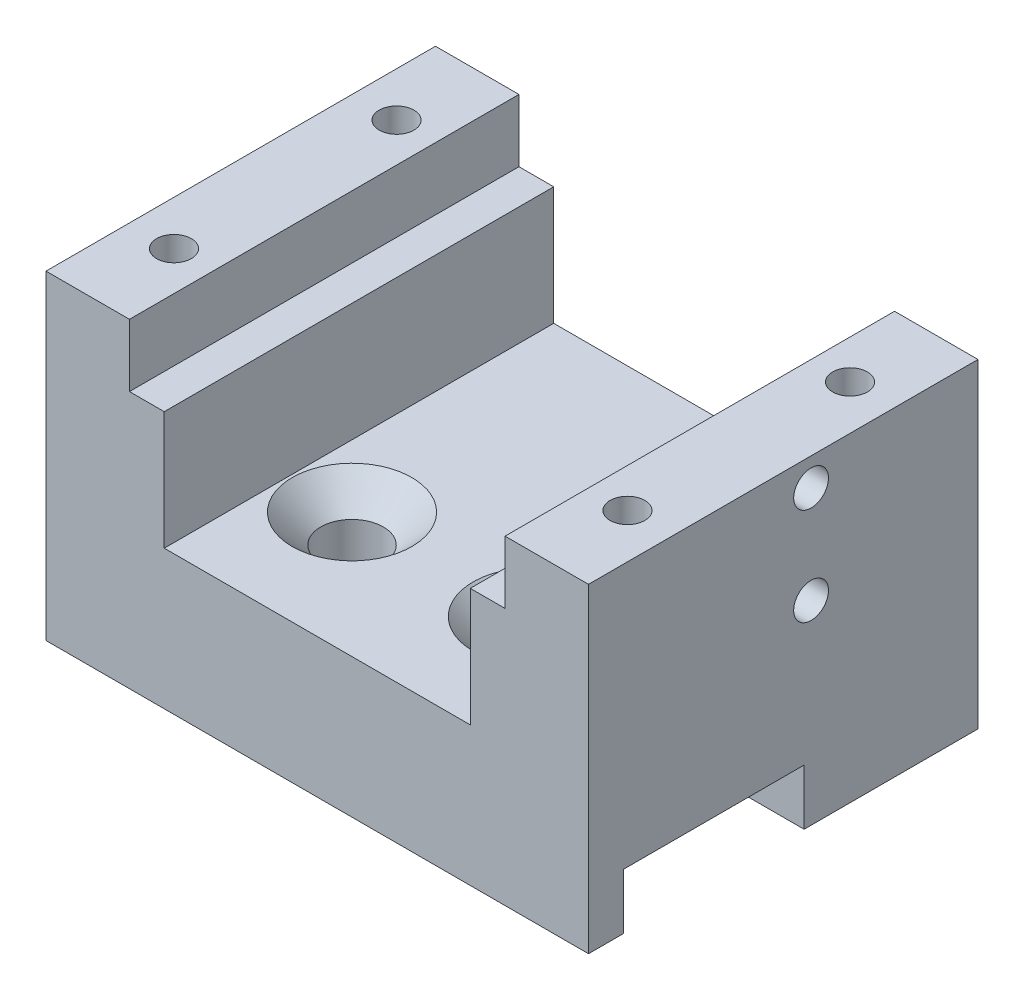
ISO-10303-21;
HEADER;
FILE_DESCRIPTION(('STEP AP214'),'2;1');
FILE_NAME('part.step','',(''),(''),'','','');
FILE_SCHEMA(('AUTOMOTIVE_DESIGN { 1 0 10303 214 1 1 1 1 }'));
ENDSEC;
DATA;
#1=APPLICATION_CONTEXT('core data for automotive mechanical design processes');
#2=APPLICATION_PROTOCOL_DEFINITION('international standard','automotive_design',2000,#1);
#3=PRODUCT_CONTEXT('',#1,'mechanical');
#4=PRODUCT('Part','Part','',(#3));
#5=PRODUCT_RELATED_PRODUCT_CATEGORY('part','',(#4));
#6=PRODUCT_DEFINITION_FORMATION('','',#4);
#7=PRODUCT_DEFINITION_CONTEXT('part definition',#1,'design');
#8=PRODUCT_DEFINITION('design','',#6,#7);
#9=PRODUCT_DEFINITION_SHAPE('','',#8);
#10=(LENGTH_UNIT() NAMED_UNIT(*) SI_UNIT(.MILLI.,.METRE.));
#11=(NAMED_UNIT(*) PLANE_ANGLE_UNIT() SI_UNIT($,.RADIAN.));
#12=(NAMED_UNIT(*) SI_UNIT($,.STERADIAN.) SOLID_ANGLE_UNIT());
#13=UNCERTAINTY_MEASURE_WITH_UNIT(LENGTH_MEASURE(1.E-05),#10,'distance_accuracy_value','');
#14=(GEOMETRIC_REPRESENTATION_CONTEXT(3) GLOBAL_UNCERTAINTY_ASSIGNED_CONTEXT((#13)) GLOBAL_UNIT_ASSIGNED_CONTEXT((#10,
#11,#12)) REPRESENTATION_CONTEXT('',''));
#15=CARTESIAN_POINT('',(0.,0.,0.));
#16=DIRECTION('',(0.,0.,1.));
#17=DIRECTION('',(1.,0.,0.));
#18=AXIS2_PLACEMENT_3D('',#15,#16,#17);
#19=CARTESIAN_POINT('',(-407.730887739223,-21.4927569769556,28.));
#20=DIRECTION('',(0.,1.,0.));
#21=DIRECTION('',(0.,0.,1.));
#22=AXIS2_PLACEMENT_3D('',#19,#20,#21);
#23=PLANE('',#22);
#24=DIRECTION('',(0.,0.,-1.));
#25=VECTOR('',#24,1.);
#26=CARTESIAN_POINT('',(-446.730887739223,-21.4927569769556,28.));
#27=LINE('',#26,#25);
#28=CARTESIAN_POINT('',(-446.730887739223,-21.4927569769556,28.));
#29=VERTEX_POINT('',#28);
#30=CARTESIAN_POINT('',(-446.730887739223,-21.4927569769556,25.5));
#31=VERTEX_POINT('',#30);
#32=EDGE_CURVE('E303',#29,#31,#27,.T.);
#33=ORIENTED_EDGE('',*,*,#32,.T.);
#34=DIRECTION('',(-1.,0.,0.));
#35=VECTOR('',#34,1.);
#36=CARTESIAN_POINT('',(-407.730887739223,-21.4927569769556,25.5));
#37=LINE('',#36,#35);
#38=CARTESIAN_POINT('',(-407.730887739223,-21.4927569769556,25.5));
#39=VERTEX_POINT('',#38);
#40=EDGE_CURVE('E254',#39,#31,#37,.T.);
#41=ORIENTED_EDGE('',*,*,#40,.F.);
#42=DIRECTION('',(0.,0.,-1.));
#43=VECTOR('',#42,1.);
#44=CARTESIAN_POINT('',(-407.730887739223,-21.4927569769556,28.));
#45=LINE('',#44,#43);
#46=CARTESIAN_POINT('',(-407.730887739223,-21.4927569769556,28.));
#47=VERTEX_POINT('',#46);
#48=EDGE_CURVE('E299',#47,#39,#45,.T.);
#49=ORIENTED_EDGE('',*,*,#48,.F.);
#50=DIRECTION('',(1.,0.,0.));
#51=VECTOR('',#50,1.);
#52=CARTESIAN_POINT('',(-407.730887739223,-21.4927569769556,28.));
#53=LINE('',#52,#51);
#54=EDGE_CURVE('E279',#29,#47,#53,.T.);
#55=ORIENTED_EDGE('',*,*,#54,.F.);
#56=EDGE_LOOP('',(#33,#41,#49,#55));
#57=FACE_BOUND('',#56,.T.);
#58=ADVANCED_FACE('F16',(#57),#23,.F.);
#59=CARTESIAN_POINT('',(-407.730887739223,-21.4927569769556,28.));
#60=DIRECTION('',(-1.,0.,0.));
#61=DIRECTION('',(0.,0.,1.));
#62=AXIS2_PLACEMENT_3D('',#59,#60,#61);
#63=PLANE('',#62);
#64=CARTESIAN_POINT('',(-407.730887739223,-7.49275697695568,11.9999999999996));
#65=DIRECTION('',(1.,0.,0.));
#66=DIRECTION('',(0.,0.,-1.));
#67=AXIS2_PLACEMENT_3D('',#64,#65,#66);
#68=CIRCLE('',#67,1.25);
#69=CARTESIAN_POINT('',(-407.730887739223,-7.49275697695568,10.7499999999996));
#70=VERTEX_POINT('',#69);
#71=EDGE_CURVE('E174',#70,#70,#68,.T.);
#72=ORIENTED_EDGE('',*,*,#71,.F.);
#73=EDGE_LOOP('',(#72));
#74=FACE_BOUND('',#73,.T.);
#75=CARTESIAN_POINT('',(-407.730887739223,-0.492756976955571,11.9999999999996));
#76=DIRECTION('',(1.,0.,0.));
#77=DIRECTION('',(0.,0.,-1.));
#78=AXIS2_PLACEMENT_3D('',#75,#76,#77);
#79=CIRCLE('',#78,1.25);
#80=CARTESIAN_POINT('',(-407.730887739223,-0.492756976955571,10.7499999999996));
#81=VERTEX_POINT('',#80);
#82=EDGE_CURVE('E180',#81,#81,#79,.T.);
#83=ORIENTED_EDGE('',*,*,#82,.F.);
#84=EDGE_LOOP('',(#83));
#85=FACE_BOUND('',#84,.T.);
#86=ORIENTED_EDGE('',*,*,#48,.T.);
#87=DIRECTION('',(0.,1.,0.));
#88=VECTOR('',#87,1.);
#89=CARTESIAN_POINT('',(-407.730887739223,-21.4927569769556,25.5));
#90=LINE('',#89,#88);
#91=CARTESIAN_POINT('',(-407.730887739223,-17.4927569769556,25.5));
#92=VERTEX_POINT('',#91);
#93=EDGE_CURVE('E237',#39,#92,#90,.T.);
#94=ORIENTED_EDGE('',*,*,#93,.T.);
#95=DIRECTION('',(0.,0.,-1.));
#96=VECTOR('',#95,1.);
#97=CARTESIAN_POINT('',(-407.730887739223,-17.4927569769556,25.5));
#98=LINE('',#97,#96);
#99=CARTESIAN_POINT('',(-407.730887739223,-17.4927569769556,12.5));
#100=VERTEX_POINT('',#99);
#101=EDGE_CURVE('E240',#92,#100,#98,.T.);
#102=ORIENTED_EDGE('',*,*,#101,.T.);
#103=DIRECTION('',(0.,-1.,0.));
#104=VECTOR('',#103,1.);
#105=CARTESIAN_POINT('',(-407.730887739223,-21.4927569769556,12.5));
#106=LINE('',#105,#104);
#107=CARTESIAN_POINT('',(-407.730887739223,-21.4927569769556,12.5));
#108=VERTEX_POINT('',#107);
#109=EDGE_CURVE('E244',#100,#108,#106,.T.);
#110=ORIENTED_EDGE('',*,*,#109,.T.);
#111=CARTESIAN_POINT('',(-407.730887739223,-21.4927569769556,0.));
#112=VERTEX_POINT('',#111);
#113=EDGE_CURVE('E281',#108,#112,#45,.T.);
#114=ORIENTED_EDGE('',*,*,#113,.T.);
#115=DIRECTION('',(0.,1.,0.));
#116=VECTOR('',#115,1.);
#117=CARTESIAN_POINT('',(-407.730887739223,-21.4927569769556,0.));
#118=LINE('',#117,#116);
#119=CARTESIAN_POINT('',(-407.730887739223,1.50724302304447,0.));
#120=VERTEX_POINT('',#119);
#121=EDGE_CURVE('E256',#112,#120,#118,.T.);
#122=ORIENTED_EDGE('',*,*,#121,.T.);
#123=DIRECTION('',(0.,0.,-1.));
#124=VECTOR('',#123,1.);
#125=CARTESIAN_POINT('',(-407.730887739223,1.50724302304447,28.));
#126=LINE('',#125,#124);
#127=CARTESIAN_POINT('',(-407.730887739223,1.50724302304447,28.));
#128=VERTEX_POINT('',#127);
#129=EDGE_CURVE('E11',#128,#120,#126,.T.);
#130=ORIENTED_EDGE('',*,*,#129,.F.);
#131=DIRECTION('',(0.,1.,0.));
#132=VECTOR('',#131,1.);
#133=CARTESIAN_POINT('',(-407.730887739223,-21.4927569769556,28.));
#134=LINE('',#133,#132);
#135=EDGE_CURVE('E263',#47,#128,#134,.T.);
#136=ORIENTED_EDGE('',*,*,#135,.F.);
#137=EDGE_LOOP('',(#86,#94,#102,#110,#114,#122,#130,#136));
#138=FACE_BOUND('',#137,.T.);
#139=ADVANCED_FACE('F18',(#74,#85,#138),#63,.F.);
#140=CARTESIAN_POINT('',(-407.730887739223,1.50724302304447,28.));
#141=DIRECTION('',(0.,-1.,0.));
#142=DIRECTION('',(1.,0.,0.));
#143=AXIS2_PLACEMENT_3D('',#140,#141,#142);
#144=PLANE('',#143);
#145=CARTESIAN_POINT('',(-410.930887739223,1.50724302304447,22.));
#146=DIRECTION('',(0.,1.,0.));
#147=DIRECTION('',(0.,0.,1.));
#148=AXIS2_PLACEMENT_3D('',#145,#146,#147);
#149=CIRCLE('',#148,1.24999999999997);
#150=CARTESIAN_POINT('',(-410.930887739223,1.50724302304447,23.25));
#151=VERTEX_POINT('',#150);
#152=EDGE_CURVE('E152',#151,#151,#149,.T.);
#153=ORIENTED_EDGE('',*,*,#152,.F.);
#154=EDGE_LOOP('',(#153));
#155=FACE_BOUND('',#154,.T.);
#156=CARTESIAN_POINT('',(-410.930887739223,1.50724302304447,5.99999999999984));
#157=DIRECTION('',(0.,1.,0.));
#158=DIRECTION('',(0.,0.,1.));
#159=AXIS2_PLACEMENT_3D('',#156,#157,#158);
#160=CIRCLE('',#159,1.24999999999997);
#161=CARTESIAN_POINT('',(-410.930887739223,1.50724302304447,7.24999999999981));
#162=VERTEX_POINT('',#161);
#163=EDGE_CURVE('E151',#162,#162,#160,.T.);
#164=ORIENTED_EDGE('',*,*,#163,.F.);
#165=EDGE_LOOP('',(#164));
#166=FACE_BOUND('',#165,.T.);
#167=DIRECTION('',(-1.,0.,0.));
#168=VECTOR('',#167,1.);
#169=CARTESIAN_POINT('',(-407.730887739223,1.50724302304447,0.));
#170=LINE('',#169,#168);
#171=CARTESIAN_POINT('',(-413.730887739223,1.50724302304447,0.));
#172=VERTEX_POINT('',#171);
#173=EDGE_CURVE('E284',#120,#172,#170,.T.);
#174=ORIENTED_EDGE('',*,*,#173,.T.);
#175=DIRECTION('',(0.,0.,-1.));
#176=VECTOR('',#175,1.);
#177=CARTESIAN_POINT('',(-413.730887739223,1.50724302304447,28.));
#178=LINE('',#177,#176);
#179=CARTESIAN_POINT('',(-413.730887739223,1.50724302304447,28.));
#180=VERTEX_POINT('',#179);
#181=EDGE_CURVE('E25',#180,#172,#178,.T.);
#182=ORIENTED_EDGE('',*,*,#181,.F.);
#183=DIRECTION('',(-1.,0.,0.));
#184=VECTOR('',#183,1.);
#185=CARTESIAN_POINT('',(-407.730887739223,1.50724302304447,28.));
#186=LINE('',#185,#184);
#187=EDGE_CURVE('E266',#128,#180,#186,.T.);
#188=ORIENTED_EDGE('',*,*,#187,.F.);
#189=ORIENTED_EDGE('',*,*,#129,.T.);
#190=EDGE_LOOP('',(#174,#182,#188,#189));
#191=FACE_BOUND('',#190,.T.);
#192=ADVANCED_FACE('F346',(#155,#166,#191),#144,.F.);
#193=CARTESIAN_POINT('',(-413.730887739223,1.50724302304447,28.));
#194=DIRECTION('',(1.,0.,0.));
#195=DIRECTION('',(0.,0.,-1.));
#196=AXIS2_PLACEMENT_3D('',#193,#194,#195);
#197=PLANE('',#196);
#198=CARTESIAN_POINT('',(-413.730887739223,-0.492756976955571,11.9999999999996));
#199=DIRECTION('',(1.,0.,0.));
#200=DIRECTION('',(0.,0.,-1.));
#201=AXIS2_PLACEMENT_3D('',#198,#199,#200);
#202=CIRCLE('',#201,1.25);
#203=CARTESIAN_POINT('',(-413.730887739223,-0.492756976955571,10.7499999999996));
#204=VERTEX_POINT('',#203);
#205=EDGE_CURVE('E183',#204,#204,#202,.T.);
#206=ORIENTED_EDGE('',*,*,#205,.T.);
#207=EDGE_LOOP('',(#206));
#208=FACE_BOUND('',#207,.T.);
#209=DIRECTION('',(0.,-1.,0.));
#210=VECTOR('',#209,1.);
#211=CARTESIAN_POINT('',(-413.730887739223,1.50724302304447,0.));
#212=LINE('',#211,#210);
#213=CARTESIAN_POINT('',(-413.730887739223,-2.99275697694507,0.));
#214=VERTEX_POINT('',#213);
#215=EDGE_CURVE('E286',#172,#214,#212,.T.);
#216=ORIENTED_EDGE('',*,*,#215,.T.);
#217=DIRECTION('',(0.,0.,-1.));
#218=VECTOR('',#217,1.);
#219=CARTESIAN_POINT('',(-413.730887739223,-2.99275697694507,28.));
#220=LINE('',#219,#218);
#221=CARTESIAN_POINT('',(-413.730887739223,-2.99275697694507,28.));
#222=VERTEX_POINT('',#221);
#223=EDGE_CURVE('E229',#222,#214,#220,.T.);
#224=ORIENTED_EDGE('',*,*,#223,.F.);
#225=DIRECTION('',(0.,-1.,0.));
#226=VECTOR('',#225,1.);
#227=CARTESIAN_POINT('',(-413.730887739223,1.50724302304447,28.));
#228=LINE('',#227,#226);
#229=EDGE_CURVE('E269',#180,#222,#228,.T.);
#230=ORIENTED_EDGE('',*,*,#229,.F.);
#231=ORIENTED_EDGE('',*,*,#181,.T.);
#232=EDGE_LOOP('',(#216,#224,#230,#231));
#233=FACE_BOUND('',#232,.T.);
#234=ADVANCED_FACE('F598',(#208,#233),#197,.F.);
#235=CARTESIAN_POINT('',(-440.730887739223,-11.4927569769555,28.));
#236=DIRECTION('',(0.,-1.,0.));
#237=DIRECTION('',(1.,0.,0.));
#238=AXIS2_PLACEMENT_3D('',#235,#236,#237);
#239=PLANE('',#238);
#240=CARTESIAN_POINT('',(-420.730887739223,-11.4927569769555,19.));
#241=DIRECTION('',(0.,1.,0.));
#242=DIRECTION('',(0.,0.,1.));
#243=AXIS2_PLACEMENT_3D('',#240,#241,#242);
#244=CIRCLE('',#243,4.3);
#245=CARTESIAN_POINT('',(-420.730887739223,-11.4927569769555,23.3));
#246=VERTEX_POINT('',#245);
#247=EDGE_CURVE('E186',#246,#246,#244,.T.);
#248=ORIENTED_EDGE('',*,*,#247,.F.);
#249=EDGE_LOOP('',(#248));
#250=FACE_BOUND('',#249,.T.);
#251=CARTESIAN_POINT('',(-433.730887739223,-11.4927569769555,19.));
#252=DIRECTION('',(0.,1.,0.));
#253=DIRECTION('',(0.,0.,1.));
#254=AXIS2_PLACEMENT_3D('',#251,#252,#253);
#255=CIRCLE('',#254,4.3);
#256=CARTESIAN_POINT('',(-433.730887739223,-11.4927569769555,23.3));
#257=VERTEX_POINT('',#256);
#258=EDGE_CURVE('E192',#257,#257,#255,.T.);
#259=ORIENTED_EDGE('',*,*,#258,.F.);
#260=EDGE_LOOP('',(#259));
#261=FACE_BOUND('',#260,.T.);
#262=DIRECTION('',(-1.,0.,0.));
#263=VECTOR('',#262,1.);
#264=CARTESIAN_POINT('',(-440.730887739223,-11.4927569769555,0.));
#265=LINE('',#264,#263);
#266=CARTESIAN_POINT('',(-416.230887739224,-11.4927569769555,0.));
#267=VERTEX_POINT('',#266);
#268=CARTESIAN_POINT('',(-438.230887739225,-11.4927569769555,0.));
#269=VERTEX_POINT('',#268);
#270=EDGE_CURVE('E288',#267,#269,#265,.T.);
#271=ORIENTED_EDGE('',*,*,#270,.T.);
#272=DIRECTION('',(0.,0.,-1.));
#273=VECTOR('',#272,1.);
#274=CARTESIAN_POINT('',(-438.230887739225,-11.4927569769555,28.));
#275=LINE('',#274,#273);
#276=CARTESIAN_POINT('',(-438.230887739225,-11.4927569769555,28.));
#277=VERTEX_POINT('',#276);
#278=EDGE_CURVE('E41',#277,#269,#275,.T.);
#279=ORIENTED_EDGE('',*,*,#278,.F.);
#280=DIRECTION('',(-1.,0.,0.));
#281=VECTOR('',#280,1.);
#282=CARTESIAN_POINT('',(-440.730887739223,-11.4927569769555,28.));
#283=LINE('',#282,#281);
#284=CARTESIAN_POINT('',(-416.230887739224,-11.4927569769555,28.));
#285=VERTEX_POINT('',#284);
#286=EDGE_CURVE('E272',#285,#277,#283,.T.);
#287=ORIENTED_EDGE('',*,*,#286,.F.);
#288=DIRECTION('',(0.,0.,-1.));
#289=VECTOR('',#288,1.);
#290=CARTESIAN_POINT('',(-416.230887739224,-11.4927569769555,28.));
#291=LINE('',#290,#289);
#292=EDGE_CURVE('E224',#285,#267,#291,.T.);
#293=ORIENTED_EDGE('',*,*,#292,.T.);
#294=EDGE_LOOP('',(#271,#279,#287,#293));
#295=FACE_BOUND('',#294,.T.);
#296=ADVANCED_FACE('F611',(#250,#261,#295),#239,.F.);
#297=CARTESIAN_POINT('',(-440.730887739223,1.50724302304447,28.));
#298=DIRECTION('',(-1.,0.,0.));
#299=DIRECTION('',(0.,0.,1.));
#300=AXIS2_PLACEMENT_3D('',#297,#298,#299);
#301=PLANE('',#300);
#302=DIRECTION('',(0.,1.,0.));
#303=VECTOR('',#302,1.);
#304=CARTESIAN_POINT('',(-440.730887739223,1.50724302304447,28.));
#305=LINE('',#304,#303);
#306=CARTESIAN_POINT('',(-440.730887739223,-2.99275697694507,28.));
#307=VERTEX_POINT('',#306);
#308=CARTESIAN_POINT('',(-440.730887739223,1.50724302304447,28.));
#309=VERTEX_POINT('',#308);
#310=EDGE_CURVE('E33',#307,#309,#305,.T.);
#311=ORIENTED_EDGE('',*,*,#310,.F.);
#312=DIRECTION('',(0.,0.,-1.));
#313=VECTOR('',#312,1.);
#314=CARTESIAN_POINT('',(-440.730887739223,-2.99275697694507,28.));
#315=LINE('',#314,#313);
#316=CARTESIAN_POINT('',(-440.730887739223,-2.99275697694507,0.));
#317=VERTEX_POINT('',#316);
#318=EDGE_CURVE('E206',#307,#317,#315,.T.);
#319=ORIENTED_EDGE('',*,*,#318,.T.);
#320=DIRECTION('',(0.,1.,0.));
#321=VECTOR('',#320,1.);
#322=CARTESIAN_POINT('',(-440.730887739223,1.50724302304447,0.));
#323=LINE('',#322,#321);
#324=CARTESIAN_POINT('',(-440.730887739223,1.50724302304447,0.));
#325=VERTEX_POINT('',#324);
#326=EDGE_CURVE('E290',#317,#325,#323,.T.);
#327=ORIENTED_EDGE('',*,*,#326,.T.);
#328=DIRECTION('',(0.,0.,-1.));
#329=VECTOR('',#328,1.);
#330=CARTESIAN_POINT('',(-440.730887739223,1.50724302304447,28.));
#331=LINE('',#330,#329);
#332=EDGE_CURVE('E309',#309,#325,#331,.T.);
#333=ORIENTED_EDGE('',*,*,#332,.F.);
#334=EDGE_LOOP('',(#311,#319,#327,#333));
#335=FACE_BOUND('',#334,.T.);
#336=ADVANCED_FACE('F621',(#335),#301,.F.);
#337=CARTESIAN_POINT('',(-440.730887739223,1.50724302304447,28.));
#338=DIRECTION('',(0.,-1.,0.));
#339=DIRECTION('',(1.,0.,0.));
#340=AXIS2_PLACEMENT_3D('',#337,#338,#339);
#341=PLANE('',#340);
#342=CARTESIAN_POINT('',(-443.530887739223,1.50724302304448,5.99999999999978));
#343=DIRECTION('',(0.,1.,0.));
#344=DIRECTION('',(0.,0.,1.));
#345=AXIS2_PLACEMENT_3D('',#342,#343,#344);
#346=CIRCLE('',#345,1.24999999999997);
#347=CARTESIAN_POINT('',(-443.530887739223,1.50724302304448,7.24999999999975));
#348=VERTEX_POINT('',#347);
#349=EDGE_CURVE('E162',#348,#348,#346,.T.);
#350=ORIENTED_EDGE('',*,*,#349,.F.);
#351=EDGE_LOOP('',(#350));
#352=FACE_BOUND('',#351,.T.);
#353=CARTESIAN_POINT('',(-443.530887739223,1.50724302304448,22.));
#354=DIRECTION('',(0.,1.,0.));
#355=DIRECTION('',(0.,0.,1.));
#356=AXIS2_PLACEMENT_3D('',#353,#354,#355);
#357=CIRCLE('',#356,1.24999999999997);
#358=CARTESIAN_POINT('',(-443.530887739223,1.50724302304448,23.25));
#359=VERTEX_POINT('',#358);
#360=EDGE_CURVE('E168',#359,#359,#357,.T.);
#361=ORIENTED_EDGE('',*,*,#360,.F.);
#362=EDGE_LOOP('',(#361));
#363=FACE_BOUND('',#362,.T.);
#364=DIRECTION('',(-1.,0.,0.));
#365=VECTOR('',#364,1.);
#366=CARTESIAN_POINT('',(-440.730887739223,1.50724302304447,0.));
#367=LINE('',#366,#365);
#368=CARTESIAN_POINT('',(-446.730887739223,1.50724302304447,0.));
#369=VERTEX_POINT('',#368);
#370=EDGE_CURVE('E292',#325,#369,#367,.T.);
#371=ORIENTED_EDGE('',*,*,#370,.T.);
#372=DIRECTION('',(0.,0.,-1.));
#373=VECTOR('',#372,1.);
#374=CARTESIAN_POINT('',(-446.730887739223,1.50724302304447,28.));
#375=LINE('',#374,#373);
#376=CARTESIAN_POINT('',(-446.730887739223,1.50724302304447,28.));
#377=VERTEX_POINT('',#376);
#378=EDGE_CURVE('E306',#377,#369,#375,.T.);
#379=ORIENTED_EDGE('',*,*,#378,.F.);
#380=DIRECTION('',(-1.,0.,0.));
#381=VECTOR('',#380,1.);
#382=CARTESIAN_POINT('',(-440.730887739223,1.50724302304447,28.));
#383=LINE('',#382,#381);
#384=EDGE_CURVE('E275',#309,#377,#383,.T.);
#385=ORIENTED_EDGE('',*,*,#384,.F.);
#386=ORIENTED_EDGE('',*,*,#332,.T.);
#387=EDGE_LOOP('',(#371,#379,#385,#386));
#388=FACE_BOUND('',#387,.T.);
#389=ADVANCED_FACE('F362',(#352,#363,#388),#341,.F.);
#390=CARTESIAN_POINT('',(-446.730887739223,-21.4927569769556,28.));
#391=DIRECTION('',(1.,0.,0.));
#392=DIRECTION('',(0.,0.,-1.));
#393=AXIS2_PLACEMENT_3D('',#390,#391,#392);
#394=PLANE('',#393);
#395=DIRECTION('',(0.,0.,-1.));
#396=VECTOR('',#395,1.);
#397=CARTESIAN_POINT('',(-446.730887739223,-17.4927569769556,25.5));
#398=LINE('',#397,#396);
#399=CARTESIAN_POINT('',(-446.730887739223,-17.4927569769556,25.5));
#400=VERTEX_POINT('',#399);
#401=CARTESIAN_POINT('',(-446.730887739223,-17.4927569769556,12.5));
#402=VERTEX_POINT('',#401);
#403=EDGE_CURVE('E250',#400,#402,#398,.T.);
#404=ORIENTED_EDGE('',*,*,#403,.F.);
#405=DIRECTION('',(0.,1.,0.));
#406=VECTOR('',#405,1.);
#407=CARTESIAN_POINT('',(-446.730887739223,-21.4927569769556,25.5));
#408=LINE('',#407,#406);
#409=EDGE_CURVE('E232',#31,#400,#408,.T.);
#410=ORIENTED_EDGE('',*,*,#409,.F.);
#411=ORIENTED_EDGE('',*,*,#32,.F.);
#412=DIRECTION('',(0.,-1.,0.));
#413=VECTOR('',#412,1.);
#414=CARTESIAN_POINT('',(-446.730887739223,-21.4927569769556,28.));
#415=LINE('',#414,#413);
#416=EDGE_CURVE('E277',#377,#29,#415,.T.);
#417=ORIENTED_EDGE('',*,*,#416,.F.);
#418=ORIENTED_EDGE('',*,*,#378,.T.);
#419=DIRECTION('',(0.,-1.,0.));
#420=VECTOR('',#419,1.);
#421=CARTESIAN_POINT('',(-446.730887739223,-21.4927569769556,0.));
#422=LINE('',#421,#420);
#423=CARTESIAN_POINT('',(-446.730887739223,-21.4927569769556,0.));
#424=VERTEX_POINT('',#423);
#425=EDGE_CURVE('E294',#369,#424,#422,.T.);
#426=ORIENTED_EDGE('',*,*,#425,.T.);
#427=CARTESIAN_POINT('',(-446.730887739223,-21.4927569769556,12.5));
#428=VERTEX_POINT('',#427);
#429=EDGE_CURVE('E302',#428,#424,#27,.T.);
#430=ORIENTED_EDGE('',*,*,#429,.F.);
#431=DIRECTION('',(0.,-1.,0.));
#432=VECTOR('',#431,1.);
#433=CARTESIAN_POINT('',(-446.730887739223,-21.4927569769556,12.5));
#434=LINE('',#433,#432);
#435=EDGE_CURVE('E241',#402,#428,#434,.T.);
#436=ORIENTED_EDGE('',*,*,#435,.F.);
#437=EDGE_LOOP('',(#404,#410,#411,#417,#418,#426,#430,#436));
#438=FACE_BOUND('',#437,.T.);
#439=ADVANCED_FACE('F352',(#438),#394,.F.);
#440=ORIENTED_EDGE('',*,*,#113,.F.);
#441=DIRECTION('',(-1.,0.,0.));
#442=VECTOR('',#441,1.);
#443=CARTESIAN_POINT('',(-407.730887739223,-21.4927569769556,12.5));
#444=LINE('',#443,#442);
#445=EDGE_CURVE('E257',#108,#428,#444,.T.);
#446=ORIENTED_EDGE('',*,*,#445,.T.);
#447=ORIENTED_EDGE('',*,*,#429,.T.);
#448=DIRECTION('',(1.,0.,0.));
#449=VECTOR('',#448,1.);
#450=CARTESIAN_POINT('',(-407.730887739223,-21.4927569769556,0.));
#451=LINE('',#450,#449);
#452=EDGE_CURVE('E267',#424,#112,#451,.T.);
#453=ORIENTED_EDGE('',*,*,#452,.T.);
#454=EDGE_LOOP('',(#440,#446,#447,#453));
#455=FACE_BOUND('',#454,.T.);
#456=ADVANCED_FACE('F341',(#455),#23,.F.);
#457=CARTESIAN_POINT('',(0.,0.,28.));
#458=DIRECTION('',(0.,0.,1.));
#459=DIRECTION('',(1.,0.,0.));
#460=AXIS2_PLACEMENT_3D('',#457,#458,#459);
#461=PLANE('',#460);
#462=DIRECTION('',(1.,0.,0.));
#463=VECTOR('',#462,1.);
#464=CARTESIAN_POINT('',(-440.730887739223,-2.99275697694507,28.));
#465=LINE('',#464,#463);
#466=CARTESIAN_POINT('',(-438.230887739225,-2.99275697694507,28.));
#467=VERTEX_POINT('',#466);
#468=EDGE_CURVE('E199',#307,#467,#465,.T.);
#469=ORIENTED_EDGE('',*,*,#468,.F.);
#470=ORIENTED_EDGE('',*,*,#310,.T.);
#471=ORIENTED_EDGE('',*,*,#384,.T.);
#472=ORIENTED_EDGE('',*,*,#416,.T.);
#473=ORIENTED_EDGE('',*,*,#54,.T.);
#474=ORIENTED_EDGE('',*,*,#135,.T.);
#475=ORIENTED_EDGE('',*,*,#187,.T.);
#476=ORIENTED_EDGE('',*,*,#229,.T.);
#477=DIRECTION('',(1.,0.,0.));
#478=VECTOR('',#477,1.);
#479=CARTESIAN_POINT('',(-413.730887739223,-2.99275697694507,28.));
#480=LINE('',#479,#478);
#481=CARTESIAN_POINT('',(-416.230887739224,-2.99275697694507,28.));
#482=VERTEX_POINT('',#481);
#483=EDGE_CURVE('E220',#482,#222,#480,.T.);
#484=ORIENTED_EDGE('',*,*,#483,.F.);
#485=DIRECTION('',(0.,1.,0.));
#486=VECTOR('',#485,1.);
#487=CARTESIAN_POINT('',(-416.230887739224,-11.4927569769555,28.));
#488=LINE('',#487,#486);
#489=EDGE_CURVE('E217',#285,#482,#488,.T.);
#490=ORIENTED_EDGE('',*,*,#489,.F.);
#491=ORIENTED_EDGE('',*,*,#286,.T.);
#492=DIRECTION('',(0.,-1.,0.));
#493=VECTOR('',#492,1.);
#494=CARTESIAN_POINT('',(-438.230887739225,-11.4927569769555,28.));
#495=LINE('',#494,#493);
#496=EDGE_CURVE('E202',#467,#277,#495,.T.);
#497=ORIENTED_EDGE('',*,*,#496,.F.);
#498=EDGE_LOOP('',(#469,#470,#471,#472,#473,#474,#475,#476,#484,#490,#491,#497));
#499=FACE_BOUND('',#498,.T.);
#500=ADVANCED_FACE('F351',(#499),#461,.T.);
#501=CARTESIAN_POINT('',(0.,0.,0.));
#502=DIRECTION('',(0.,0.,1.));
#503=DIRECTION('',(1.,0.,0.));
#504=AXIS2_PLACEMENT_3D('',#501,#502,#503);
#505=PLANE('',#504);
#506=ORIENTED_EDGE('',*,*,#326,.F.);
#507=DIRECTION('',(1.,0.,0.));
#508=VECTOR('',#507,1.);
#509=CARTESIAN_POINT('',(-440.730887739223,-2.99275697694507,0.));
#510=LINE('',#509,#508);
#511=CARTESIAN_POINT('',(-438.230887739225,-2.99275697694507,0.));
#512=VERTEX_POINT('',#511);
#513=EDGE_CURVE('E207',#317,#512,#510,.T.);
#514=ORIENTED_EDGE('',*,*,#513,.T.);
#515=DIRECTION('',(0.,-1.,0.));
#516=VECTOR('',#515,1.);
#517=CARTESIAN_POINT('',(-438.230887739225,-11.4927569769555,0.));
#518=LINE('',#517,#516);
#519=EDGE_CURVE('E203',#512,#269,#518,.T.);
#520=ORIENTED_EDGE('',*,*,#519,.T.);
#521=ORIENTED_EDGE('',*,*,#270,.F.);
#522=DIRECTION('',(0.,1.,0.));
#523=VECTOR('',#522,1.);
#524=CARTESIAN_POINT('',(-416.230887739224,-11.4927569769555,0.));
#525=LINE('',#524,#523);
#526=CARTESIAN_POINT('',(-416.230887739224,-2.99275697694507,0.));
#527=VERTEX_POINT('',#526);
#528=EDGE_CURVE('E213',#267,#527,#525,.T.);
#529=ORIENTED_EDGE('',*,*,#528,.T.);
#530=DIRECTION('',(1.,0.,0.));
#531=VECTOR('',#530,1.);
#532=CARTESIAN_POINT('',(-413.730887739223,-2.99275697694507,0.));
#533=LINE('',#532,#531);
#534=EDGE_CURVE('E221',#527,#214,#533,.T.);
#535=ORIENTED_EDGE('',*,*,#534,.T.);
#536=ORIENTED_EDGE('',*,*,#215,.F.);
#537=ORIENTED_EDGE('',*,*,#173,.F.);
#538=ORIENTED_EDGE('',*,*,#121,.F.);
#539=ORIENTED_EDGE('',*,*,#452,.F.);
#540=ORIENTED_EDGE('',*,*,#425,.F.);
#541=ORIENTED_EDGE('',*,*,#370,.F.);
#542=EDGE_LOOP('',(#506,#514,#520,#521,#529,#535,#536,#537,#538,#539,#540,#541));
#543=FACE_BOUND('',#542,.T.);
#544=ADVANCED_FACE('F359',(#543),#505,.F.);
#545=CARTESIAN_POINT('',(-407.730887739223,-21.4927569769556,25.5));
#546=DIRECTION('',(0.,0.,1.));
#547=DIRECTION('',(1.,0.,0.));
#548=AXIS2_PLACEMENT_3D('',#545,#546,#547);
#549=PLANE('',#548);
#550=ORIENTED_EDGE('',*,*,#409,.T.);
#551=DIRECTION('',(-1.,0.,0.));
#552=VECTOR('',#551,1.);
#553=CARTESIAN_POINT('',(-407.730887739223,-17.4927569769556,25.5));
#554=LINE('',#553,#552);
#555=EDGE_CURVE('E247',#92,#400,#554,.T.);
#556=ORIENTED_EDGE('',*,*,#555,.F.);
#557=ORIENTED_EDGE('',*,*,#93,.F.);
#558=ORIENTED_EDGE('',*,*,#40,.T.);
#559=EDGE_LOOP('',(#550,#556,#557,#558));
#560=FACE_BOUND('',#559,.T.);
#561=ADVANCED_FACE('F393',(#560),#549,.F.);
#562=CARTESIAN_POINT('',(-407.730887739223,-21.4927569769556,12.5));
#563=DIRECTION('',(0.,0.,-1.));
#564=DIRECTION('',(-1.,0.,0.));
#565=AXIS2_PLACEMENT_3D('',#562,#563,#564);
#566=PLANE('',#565);
#567=ORIENTED_EDGE('',*,*,#435,.T.);
#568=ORIENTED_EDGE('',*,*,#445,.F.);
#569=ORIENTED_EDGE('',*,*,#109,.F.);
#570=DIRECTION('',(-1.,0.,0.));
#571=VECTOR('',#570,1.);
#572=CARTESIAN_POINT('',(-407.730887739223,-17.4927569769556,12.5));
#573=LINE('',#572,#571);
#574=EDGE_CURVE('E260',#100,#402,#573,.T.);
#575=ORIENTED_EDGE('',*,*,#574,.T.);
#576=EDGE_LOOP('',(#567,#568,#569,#575));
#577=FACE_BOUND('',#576,.T.);
#578=ADVANCED_FACE('F373',(#577),#566,.F.);
#579=CARTESIAN_POINT('',(-407.730887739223,-17.4927569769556,25.5));
#580=DIRECTION('',(0.,1.,0.));
#581=DIRECTION('',(0.,0.,1.));
#582=AXIS2_PLACEMENT_3D('',#579,#580,#581);
#583=PLANE('',#582);
#584=CARTESIAN_POINT('',(-420.730887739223,-17.4927569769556,19.));
#585=DIRECTION('',(0.,1.,0.));
#586=DIRECTION('',(0.,0.,1.));
#587=AXIS2_PLACEMENT_3D('',#584,#585,#586);
#588=CIRCLE('',#587,2.24999999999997);
#589=CARTESIAN_POINT('',(-420.730887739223,-17.4927569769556,21.25));
#590=VERTEX_POINT('',#589);
#591=EDGE_CURVE('E20',#590,#590,#588,.T.);
#592=ORIENTED_EDGE('',*,*,#591,.T.);
#593=EDGE_LOOP('',(#592));
#594=FACE_BOUND('',#593,.T.);
#595=CARTESIAN_POINT('',(-433.730887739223,-17.4927569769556,19.));
#596=DIRECTION('',(0.,1.,0.));
#597=DIRECTION('',(0.,0.,1.));
#598=AXIS2_PLACEMENT_3D('',#595,#596,#597);
#599=CIRCLE('',#598,2.24999999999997);
#600=CARTESIAN_POINT('',(-433.730887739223,-17.4927569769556,21.25));
#601=VERTEX_POINT('',#600);
#602=EDGE_CURVE('E198',#601,#601,#599,.T.);
#603=ORIENTED_EDGE('',*,*,#602,.T.);
#604=EDGE_LOOP('',(#603));
#605=FACE_BOUND('',#604,.T.);
#606=ORIENTED_EDGE('',*,*,#403,.T.);
#607=ORIENTED_EDGE('',*,*,#574,.F.);
#608=ORIENTED_EDGE('',*,*,#101,.F.);
#609=ORIENTED_EDGE('',*,*,#555,.T.);
#610=EDGE_LOOP('',(#606,#607,#608,#609));
#611=FACE_BOUND('',#610,.T.);
#612=ADVANCED_FACE('F316',(#594,#605,#611),#583,.F.);
#613=CARTESIAN_POINT('',(-413.730887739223,-2.99275697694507,28.));
#614=DIRECTION('',(0.,1.,0.));
#615=DIRECTION('',(0.,0.,1.));
#616=AXIS2_PLACEMENT_3D('',#613,#614,#615);
#617=PLANE('',#616);
#618=ORIENTED_EDGE('',*,*,#534,.F.);
#619=DIRECTION('',(0.,0.,-1.));
#620=VECTOR('',#619,1.);
#621=CARTESIAN_POINT('',(-416.230887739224,-2.99275697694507,28.));
#622=LINE('',#621,#620);
#623=EDGE_CURVE('E233',#482,#527,#622,.T.);
#624=ORIENTED_EDGE('',*,*,#623,.F.);
#625=ORIENTED_EDGE('',*,*,#483,.T.);
#626=ORIENTED_EDGE('',*,*,#223,.T.);
#627=EDGE_LOOP('',(#618,#624,#625,#626));
#628=FACE_BOUND('',#627,.T.);
#629=ADVANCED_FACE('F395',(#628),#617,.T.);
#630=CARTESIAN_POINT('',(-416.230887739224,-11.4927569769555,28.));
#631=DIRECTION('',(-1.,0.,0.));
#632=DIRECTION('',(0.,0.,1.));
#633=AXIS2_PLACEMENT_3D('',#630,#631,#632);
#634=PLANE('',#633);
#635=CARTESIAN_POINT('',(-416.230887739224,-7.49275697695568,11.9999999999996));
#636=DIRECTION('',(-1.,0.,0.));
#637=DIRECTION('',(0.,0.,1.));
#638=AXIS2_PLACEMENT_3D('',#635,#636,#637);
#639=CIRCLE('',#638,1.25);
#640=CARTESIAN_POINT('',(-416.230887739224,-7.49275697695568,13.2499999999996));
#641=VERTEX_POINT('',#640);
#642=EDGE_CURVE('E177',#641,#641,#639,.T.);
#643=ORIENTED_EDGE('',*,*,#642,.F.);
#644=EDGE_LOOP('',(#643));
#645=FACE_BOUND('',#644,.T.);
#646=ORIENTED_EDGE('',*,*,#528,.F.);
#647=ORIENTED_EDGE('',*,*,#292,.F.);
#648=ORIENTED_EDGE('',*,*,#489,.T.);
#649=ORIENTED_EDGE('',*,*,#623,.T.);
#650=EDGE_LOOP('',(#646,#647,#648,#649));
#651=FACE_BOUND('',#650,.T.);
#652=ADVANCED_FACE('F403',(#645,#651),#634,.T.);
#653=CARTESIAN_POINT('',(-438.230887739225,-11.4927569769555,28.));
#654=DIRECTION('',(1.,0.,0.));
#655=DIRECTION('',(0.,0.,-1.));
#656=AXIS2_PLACEMENT_3D('',#653,#654,#655);
#657=PLANE('',#656);
#658=ORIENTED_EDGE('',*,*,#519,.F.);
#659=DIRECTION('',(0.,0.,-1.));
#660=VECTOR('',#659,1.);
#661=CARTESIAN_POINT('',(-438.230887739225,-2.99275697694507,28.));
#662=LINE('',#661,#660);
#663=EDGE_CURVE('E214',#467,#512,#662,.T.);
#664=ORIENTED_EDGE('',*,*,#663,.F.);
#665=ORIENTED_EDGE('',*,*,#496,.T.);
#666=ORIENTED_EDGE('',*,*,#278,.T.);
#667=EDGE_LOOP('',(#658,#664,#665,#666));
#668=FACE_BOUND('',#667,.T.);
#669=ADVANCED_FACE('F334',(#668),#657,.T.);
#670=CARTESIAN_POINT('',(-440.730887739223,-2.99275697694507,28.));
#671=DIRECTION('',(0.,1.,0.));
#672=DIRECTION('',(0.,0.,1.));
#673=AXIS2_PLACEMENT_3D('',#670,#671,#672);
#674=PLANE('',#673);
#675=ORIENTED_EDGE('',*,*,#513,.F.);
#676=ORIENTED_EDGE('',*,*,#318,.F.);
#677=ORIENTED_EDGE('',*,*,#468,.T.);
#678=ORIENTED_EDGE('',*,*,#663,.T.);
#679=EDGE_LOOP('',(#675,#676,#677,#678));
#680=FACE_BOUND('',#679,.T.);
#681=ADVANCED_FACE('F322',(#680),#674,.T.);
#682=CARTESIAN_POINT('',(-433.730887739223,-11.4927569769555,19.));
#683=DIRECTION('',(0.,1.,0.));
#684=DIRECTION('',(0.,0.,1.));
#685=AXIS2_PLACEMENT_3D('',#682,#683,#684);
#686=CYLINDRICAL_SURFACE('',#685,2.24999999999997);
#687=CARTESIAN_POINT('',(-433.730887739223,-13.5427569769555,19.));
#688=DIRECTION('',(0.,1.,0.));
#689=DIRECTION('',(0.,0.,1.));
#690=AXIS2_PLACEMENT_3D('',#687,#688,#689);
#691=CIRCLE('',#690,2.24999999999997);
#692=CARTESIAN_POINT('',(-433.730887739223,-13.5427569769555,21.25));
#693=VERTEX_POINT('',#692);
#694=EDGE_CURVE('E195',#693,#693,#691,.T.);
#695=ORIENTED_EDGE('',*,*,#694,.T.);
#696=EDGE_LOOP('',(#695));
#697=FACE_BOUND('',#696,.T.);
#698=ORIENTED_EDGE('',*,*,#602,.F.);
#699=EDGE_LOOP('',(#698));
#700=FACE_BOUND('',#699,.T.);
#701=ADVANCED_FACE('F319',(#697,#700),#686,.F.);
#702=CARTESIAN_POINT('',(-433.730887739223,-11.4927569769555,19.));
#703=DIRECTION('',(0.,1.,0.));
#704=DIRECTION('',(0.,0.,1.));
#705=AXIS2_PLACEMENT_3D('',#702,#703,#704);
#706=CONICAL_SURFACE('',#705,4.3,0.78539816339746);
#707=ORIENTED_EDGE('',*,*,#694,.F.);
#708=EDGE_LOOP('',(#707));
#709=FACE_BOUND('',#708,.T.);
#710=ORIENTED_EDGE('',*,*,#258,.T.);
#711=EDGE_LOOP('',(#710));
#712=FACE_BOUND('',#711,.T.);
#713=ADVANCED_FACE('F321',(#709,#712),#706,.F.);
#714=CARTESIAN_POINT('',(-420.730887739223,-11.4927569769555,19.));
#715=DIRECTION('',(0.,1.,0.));
#716=DIRECTION('',(0.,0.,1.));
#717=AXIS2_PLACEMENT_3D('',#714,#715,#716);
#718=CYLINDRICAL_SURFACE('',#717,2.24999999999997);
#719=CARTESIAN_POINT('',(-420.730887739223,-13.5427569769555,19.));
#720=DIRECTION('',(0.,1.,0.));
#721=DIRECTION('',(0.,0.,1.));
#722=AXIS2_PLACEMENT_3D('',#719,#720,#721);
#723=CIRCLE('',#722,2.24999999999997);
#724=CARTESIAN_POINT('',(-420.730887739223,-13.5427569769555,21.25));
#725=VERTEX_POINT('',#724);
#726=EDGE_CURVE('E189',#725,#725,#723,.T.);
#727=ORIENTED_EDGE('',*,*,#726,.T.);
#728=EDGE_LOOP('',(#727));
#729=FACE_BOUND('',#728,.T.);
#730=ORIENTED_EDGE('',*,*,#591,.F.);
#731=EDGE_LOOP('',(#730));
#732=FACE_BOUND('',#731,.T.);
#733=ADVANCED_FACE('F331',(#729,#732),#718,.F.);
#734=CARTESIAN_POINT('',(-420.730887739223,-11.4927569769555,19.));
#735=DIRECTION('',(0.,1.,0.));
#736=DIRECTION('',(0.,0.,1.));
#737=AXIS2_PLACEMENT_3D('',#734,#735,#736);
#738=CONICAL_SURFACE('',#737,4.3,0.78539816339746);
#739=ORIENTED_EDGE('',*,*,#726,.F.);
#740=EDGE_LOOP('',(#739));
#741=FACE_BOUND('',#740,.T.);
#742=ORIENTED_EDGE('',*,*,#247,.T.);
#743=EDGE_LOOP('',(#742));
#744=FACE_BOUND('',#743,.T.);
#745=ADVANCED_FACE('F486',(#741,#744),#738,.F.);
#746=CARTESIAN_POINT('',(-407.730887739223,-0.492756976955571,11.9999999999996));
#747=DIRECTION('',(1.,0.,0.));
#748=DIRECTION('',(0.,0.,-1.));
#749=AXIS2_PLACEMENT_3D('',#746,#747,#748);
#750=CYLINDRICAL_SURFACE('',#749,1.25);
#751=ORIENTED_EDGE('',*,*,#82,.T.);
#752=EDGE_LOOP('',(#751));
#753=FACE_BOUND('',#752,.T.);
#754=ORIENTED_EDGE('',*,*,#205,.F.);
#755=EDGE_LOOP('',(#754));
#756=FACE_BOUND('',#755,.T.);
#757=ADVANCED_FACE('F497',(#753,#756),#750,.F.);
#758=CARTESIAN_POINT('',(-407.730887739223,-7.49275697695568,11.9999999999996));
#759=DIRECTION('',(1.,0.,0.));
#760=DIRECTION('',(0.,0.,-1.));
#761=AXIS2_PLACEMENT_3D('',#758,#759,#760);
#762=CYLINDRICAL_SURFACE('',#761,1.25);
#763=ORIENTED_EDGE('',*,*,#642,.T.);
#764=EDGE_LOOP('',(#763));
#765=FACE_BOUND('',#764,.T.);
#766=ORIENTED_EDGE('',*,*,#71,.T.);
#767=EDGE_LOOP('',(#766));
#768=FACE_BOUND('',#767,.T.);
#769=ADVANCED_FACE('F507',(#765,#768),#762,.F.);
#770=CARTESIAN_POINT('',(-443.530887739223,-10.9927569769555,22.));
#771=DIRECTION('',(0.,1.,0.));
#772=DIRECTION('',(0.,0.,1.));
#773=AXIS2_PLACEMENT_3D('',#770,#771,#772);
#774=CONICAL_SURFACE('',#773,1.24999999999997,1.02974425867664);
#775=CARTESIAN_POINT('',(-443.530887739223,-11.74383275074,22.));
#776=VERTEX_POINT('',#775);
#777=VERTEX_LOOP('',#776);
#778=FACE_BOUND('',#777,.T.);
#779=CARTESIAN_POINT('',(-443.530887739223,-10.9927569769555,22.));
#780=DIRECTION('',(0.,1.,0.));
#781=DIRECTION('',(0.,0.,1.));
#782=AXIS2_PLACEMENT_3D('',#779,#780,#781);
#783=CIRCLE('',#782,1.24999999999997);
#784=CARTESIAN_POINT('',(-443.530887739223,-10.9927569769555,23.25));
#785=VERTEX_POINT('',#784);
#786=EDGE_CURVE('E171',#785,#785,#783,.T.);
#787=ORIENTED_EDGE('',*,*,#786,.T.);
#788=EDGE_LOOP('',(#787));
#789=FACE_BOUND('',#788,.T.);
#790=ADVANCED_FACE('F517',(#778,#789),#774,.F.);
#791=CARTESIAN_POINT('',(-443.530887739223,1.50724302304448,22.));
#792=DIRECTION('',(0.,1.,0.));
#793=DIRECTION('',(0.,0.,1.));
#794=AXIS2_PLACEMENT_3D('',#791,#792,#793);
#795=CYLINDRICAL_SURFACE('',#794,1.24999999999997);
#796=ORIENTED_EDGE('',*,*,#786,.F.);
#797=EDGE_LOOP('',(#796));
#798=FACE_BOUND('',#797,.T.);
#799=ORIENTED_EDGE('',*,*,#360,.T.);
#800=EDGE_LOOP('',(#799));
#801=FACE_BOUND('',#800,.T.);
#802=ADVANCED_FACE('F527',(#798,#801),#795,.F.);
#803=CARTESIAN_POINT('',(-443.530887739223,-10.9927569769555,5.99999999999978));
#804=DIRECTION('',(0.,1.,0.));
#805=DIRECTION('',(0.,0.,1.));
#806=AXIS2_PLACEMENT_3D('',#803,#804,#805);
#807=CONICAL_SURFACE('',#806,1.24999999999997,1.02974425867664);
#808=CARTESIAN_POINT('',(-443.530887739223,-11.74383275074,5.99999999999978));
#809=VERTEX_POINT('',#808);
#810=VERTEX_LOOP('',#809);
#811=FACE_BOUND('',#810,.T.);
#812=CARTESIAN_POINT('',(-443.530887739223,-10.9927569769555,5.99999999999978));
#813=DIRECTION('',(0.,1.,0.));
#814=DIRECTION('',(0.,0.,1.));
#815=AXIS2_PLACEMENT_3D('',#812,#813,#814);
#816=CIRCLE('',#815,1.24999999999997);
#817=CARTESIAN_POINT('',(-443.530887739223,-10.9927569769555,7.24999999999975));
#818=VERTEX_POINT('',#817);
#819=EDGE_CURVE('E165',#818,#818,#816,.T.);
#820=ORIENTED_EDGE('',*,*,#819,.T.);
#821=EDGE_LOOP('',(#820));
#822=FACE_BOUND('',#821,.T.);
#823=ADVANCED_FACE('F537',(#811,#822),#807,.F.);
#824=CARTESIAN_POINT('',(-443.530887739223,1.50724302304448,5.99999999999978));
#825=DIRECTION('',(0.,1.,0.));
#826=DIRECTION('',(0.,0.,1.));
#827=AXIS2_PLACEMENT_3D('',#824,#825,#826);
#828=CYLINDRICAL_SURFACE('',#827,1.24999999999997);
#829=ORIENTED_EDGE('',*,*,#819,.F.);
#830=EDGE_LOOP('',(#829));
#831=FACE_BOUND('',#830,.T.);
#832=ORIENTED_EDGE('',*,*,#349,.T.);
#833=EDGE_LOOP('',(#832));
#834=FACE_BOUND('',#833,.T.);
#835=ADVANCED_FACE('F547',(#831,#834),#828,.F.);
#836=CARTESIAN_POINT('',(-410.930887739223,-10.9927569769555,5.99999999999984));
#837=DIRECTION('',(0.,1.,0.));
#838=DIRECTION('',(0.,0.,1.));
#839=AXIS2_PLACEMENT_3D('',#836,#837,#838);
#840=CONICAL_SURFACE('',#839,1.24999999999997,1.02974425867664);
#841=CARTESIAN_POINT('',(-410.930887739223,-11.74383275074,5.99999999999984));
#842=VERTEX_POINT('',#841);
#843=VERTEX_LOOP('',#842);
#844=FACE_BOUND('',#843,.T.);
#845=CARTESIAN_POINT('',(-410.930887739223,-10.9927569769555,5.99999999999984));
#846=DIRECTION('',(0.,1.,0.));
#847=DIRECTION('',(0.,0.,1.));
#848=AXIS2_PLACEMENT_3D('',#845,#846,#847);
#849=CIRCLE('',#848,1.24999999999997);
#850=CARTESIAN_POINT('',(-410.930887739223,-10.9927569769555,7.24999999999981));
#851=VERTEX_POINT('',#850);
#852=EDGE_CURVE('E155',#851,#851,#849,.T.);
#853=ORIENTED_EDGE('',*,*,#852,.T.);
#854=EDGE_LOOP('',(#853));
#855=FACE_BOUND('',#854,.T.);
#856=ADVANCED_FACE('F557',(#844,#855),#840,.F.);
#857=CARTESIAN_POINT('',(-410.930887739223,1.50724302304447,5.99999999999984));
#858=DIRECTION('',(0.,1.,0.));
#859=DIRECTION('',(0.,0.,1.));
#860=AXIS2_PLACEMENT_3D('',#857,#858,#859);
#861=CYLINDRICAL_SURFACE('',#860,1.24999999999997);
#862=ORIENTED_EDGE('',*,*,#852,.F.);
#863=EDGE_LOOP('',(#862));
#864=FACE_BOUND('',#863,.T.);
#865=ORIENTED_EDGE('',*,*,#163,.T.);
#866=EDGE_LOOP('',(#865));
#867=FACE_BOUND('',#866,.T.);
#868=ADVANCED_FACE('F145',(#864,#867),#861,.F.);
#869=CARTESIAN_POINT('',(-410.930887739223,-10.9927569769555,22.));
#870=DIRECTION('',(0.,1.,0.));
#871=DIRECTION('',(0.,0.,1.));
#872=AXIS2_PLACEMENT_3D('',#869,#870,#871);
#873=CONICAL_SURFACE('',#872,1.24999999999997,1.02974425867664);
#874=CARTESIAN_POINT('',(-410.930887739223,-11.74383275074,22.));
#875=VERTEX_POINT('',#874);
#876=VERTEX_LOOP('',#875);
#877=FACE_BOUND('',#876,.T.);
#878=CARTESIAN_POINT('',(-410.930887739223,-10.9927569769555,22.));
#879=DIRECTION('',(0.,1.,0.));
#880=DIRECTION('',(0.,0.,1.));
#881=AXIS2_PLACEMENT_3D('',#878,#879,#880);
#882=CIRCLE('',#881,1.24999999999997);
#883=CARTESIAN_POINT('',(-410.930887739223,-10.9927569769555,23.25));
#884=VERTEX_POINT('',#883);
#885=EDGE_CURVE('E149',#884,#884,#882,.T.);
#886=ORIENTED_EDGE('',*,*,#885,.T.);
#887=EDGE_LOOP('',(#886));
#888=FACE_BOUND('',#887,.T.);
#889=ADVANCED_FACE('F141',(#877,#888),#873,.F.);
#890=CARTESIAN_POINT('',(-410.930887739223,1.50724302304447,22.));
#891=DIRECTION('',(0.,1.,0.));
#892=DIRECTION('',(0.,0.,1.));
#893=AXIS2_PLACEMENT_3D('',#890,#891,#892);
#894=CYLINDRICAL_SURFACE('',#893,1.24999999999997);
#895=ORIENTED_EDGE('',*,*,#885,.F.);
#896=EDGE_LOOP('',(#895));
#897=FACE_BOUND('',#896,.T.);
#898=ORIENTED_EDGE('',*,*,#152,.T.);
#899=EDGE_LOOP('',(#898));
#900=FACE_BOUND('',#899,.T.);
#901=ADVANCED_FACE('F144',(#897,#900),#894,.F.);
#902=CLOSED_SHELL('',(#58,#139,#192,#234,#296,#336,#389,#439,#456,#500,#544,#561,#578,#612,#629,
#652,#669,#681,#701,#713,#733,#745,#757,#769,#790,#802,#823,#835,#856,#868,#889,#901));
#903=MANIFOLD_SOLID_BREP('B1',#902);
#904=ADVANCED_BREP_SHAPE_REPRESENTATION('',(#18,#903),#14);
#905=SHAPE_DEFINITION_REPRESENTATION(#9,#904);
ENDSEC;
END-ISO-10303-21;
